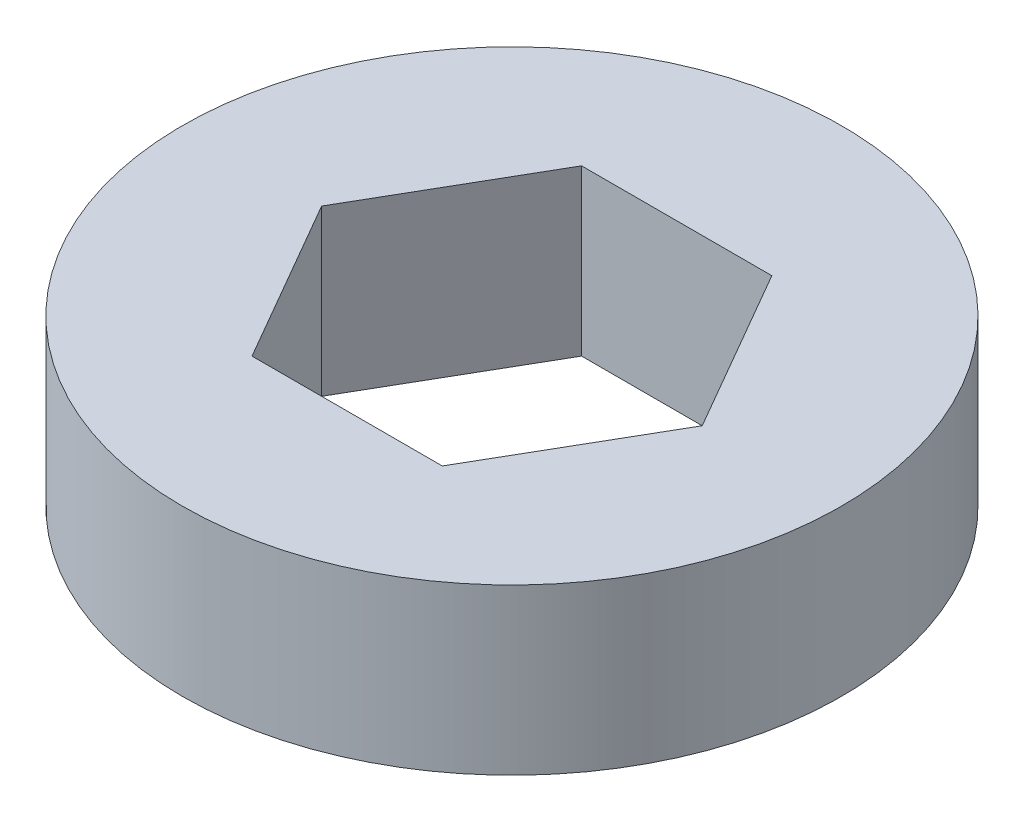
from build123d import *

# Parameters (mm, degrees)
SKETCH1_R           = 20
BOSS_EXTRUDE1_DEPTH = 10


with BuildPart() as part:
    # Sketch1 → Boss-Extrude1 (new body)
    with BuildSketch(Plane(origin=(0, 0, 0), x_dir=(1, 0, 0), z_dir=(0, 1, 0))):
        with Locations(Location((0, 0, 0), (0, 0, 270))):
            Circle(SKETCH1_R)
        Polygon((11.547005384, 0), (5.773502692, 10), (-5.773502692, 10), (-11.547005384, 0), (-5.773502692, -10), (5.773502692, -10), align=None, mode=Mode.SUBTRACT)
    extrude(amount=BOSS_EXTRUDE1_DEPTH)


solid = part.part
